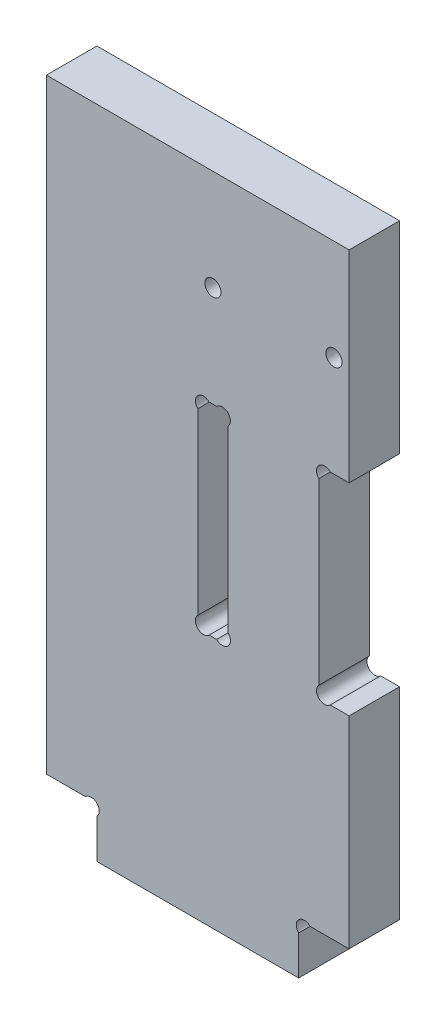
from build123d import *

# Parameters (mm, degrees)
ESQUISSE1_R      = 1.6
EXTRUSION1_DEPTH = 10


with BuildPart() as part:
    # Esquisse1 → Extrusion1 (new body)
    with BuildSketch(Plane.XY):
        with BuildLine():
            Line((326.2627417, 50), (330, 50))
            Line((330, 50), (330, 10))
            Line((330, 10), (322.2627417, 10))
            ThreePointArc((322.2627417, 10), (320, 10), (320, 7.7372583))
            Line((320, 7.7372583), (320, 0))
            Line((320, 0), (280, 0))
            Line((280, 0), (280, 7.7372583))
            ThreePointArc((280, 7.7372583), (280, 10), (277.7372583, 10))
            Line((277.7372583, 10), (270, 10))
            Line((270, 10), (270, 130))
            Line((270, 130), (330, 130))
            Line((330, 130), (330, 90))
            Line((330, 90), (326.2627417, 90))
            ThreePointArc((326.2627417, 90), (324, 90), (324, 87.7372583))
            Line((324, 87.7372583), (324, 52.2627417))
            ThreePointArc((324, 52.2627417), (324, 50), (326.2627417, 50))
        make_face()
        with Locations(Location((327, 110, 0), (0, 0, 180))):
            Circle(ESQUISSE1_R, mode=Mode.SUBTRACT)
        with Locations((303, 110)):
            Circle(ESQUISSE1_R, mode=Mode.SUBTRACT)
        with BuildLine():
            Line((302.2627417, 50), (303.7372583, 50))
            ThreePointArc((303.7372583, 50), (306, 50), (306, 52.2627417))
            Line((306, 52.2627417), (306, 87.7372583))
            ThreePointArc((306, 87.7372583), (306, 90), (303.7372583, 90))
            Line((303.7372583, 90), (302.2627417, 90))
            ThreePointArc((302.2627417, 90), (300, 90), (300, 87.7372583))
            Line((300, 87.7372583), (300, 52.2627417))
            ThreePointArc((300, 52.2627417), (300, 50), (302.2627417, 50))
        make_face(mode=Mode.SUBTRACT)
    extrude(amount=EXTRUSION1_DEPTH)


solid = part.part
